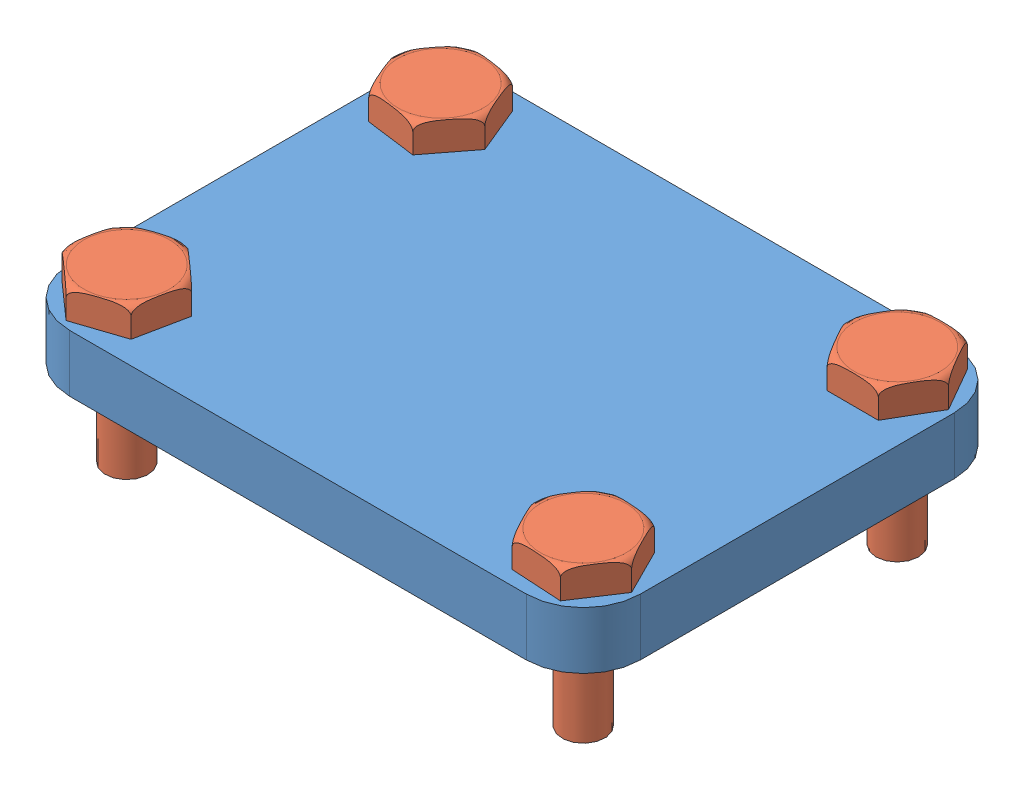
SolidWorks assembly coincident mate.SLDASM, configuration Default (file format 11000). Lengths in mm.
Overall size (206.05 60.93 157.74).
5 component instances, 2 part files, 8 mates.
Components (placement in the parent):
- base_plate-1: base_plate.SLDPRT [Default] at (-2.4395 -20.7211 8.571) size (200 20 150)
- bolt-1: bolt.SLDPRT [Default] at (-82.4395 -50.7211 -46.429) x (-0.381831 0 -0.924232) z (0.924232 0 -0.381831) size (37.56 60.93 32.74)
- bolt-2: bolt.SLDPRT [Default] at (77.5605 -50.7211 -46.429) x (0.999997 0 0.002425) z (-0.002425 0 0.999997) size (37.56 60.93 32.74)
- bolt-3: bolt.SLDPRT [Default] at (-82.4395 -50.7211 63.571) x (0.948787 0 -0.315917) z (0.315917 0 0.948787) size (37.56 60.93 32.74)
- bolt-4: bolt.SLDPRT [Default] at (77.5605 -50.7211 63.571) x (0.448221 0 0.893923) z (-0.893923 0 0.448221) size (37.56 60.93 32.74)
Mates (geometry in assembly coordinates):
- Concentric2: concentric: cylinder of assembly; cylinder of assembly; cylinder of base_plate-1 through (-82.4395 -0.7211 63.571) axis (0 1 0) radius 7.5; cylinder of bolt-3 through (-82.4395 -0.7211 63.571) axis (0 -1 0) radius 7.5
- Concentric3: concentric: cylinder of assembly; cylinder of assembly; cylinder of base_plate-1 through (77.5605 -0.7211 -46.429) axis (0 1 0) radius 7.5; cylinder of bolt-2 through (77.5605 -0.7211 -46.429) axis (0 -1 0) radius 7.5
- Concentric4: concentric: cylinder of assembly; cylinder of assembly; cylinder of base_plate-1 through (77.5605 -0.7211 63.571) axis (0 1 0) radius 7.5; cylinder of bolt-4 through (77.5605 -0.7211 63.571) axis (0 -1 0) radius 7.5
- Concentric5: concentric: cylinder of assembly; cylinder of assembly; cylinder of base_plate-1 through (-82.4395 -0.7211 -46.429) axis (0 1 0) radius 7.5; cylinder of bolt-1 through (-82.4395 -0.7211 -46.429) axis (0 -1 0) radius 7.5
- Coincident4: coincident: plane of assembly; plane of assembly; plane of base_plate-1 through (-102.4395 -0.7211 -66.429) normal (0 1 0); plane of bolt-3 through (-68.9757 -0.7211 75.5179) normal (0 -1 0)
- Coincident5: coincident: plane of assembly; plane of assembly; plane of base_plate-1 through (-102.4395 -0.7211 -66.429) normal (0 1 0); plane of bolt-1 through (-71.4686 -0.7211 -60.6992) normal (0 -1 0)
- Coincident6: coincident: plane of assembly; plane of assembly; plane of base_plate-1 through (-102.4395 -0.7211 -66.429) normal (0 1 0); plane of bolt-4 through (67.6596 -0.7211 78.6034) normal (0 -1 0)
- Coincident7: coincident: plane of assembly; plane of assembly; plane of base_plate-1 through (-102.4395 -0.7211 -66.429) normal (0 1 0); plane of bolt-2 through (86.5227 -0.7211 -30.8187) normal (0 -1 0)
